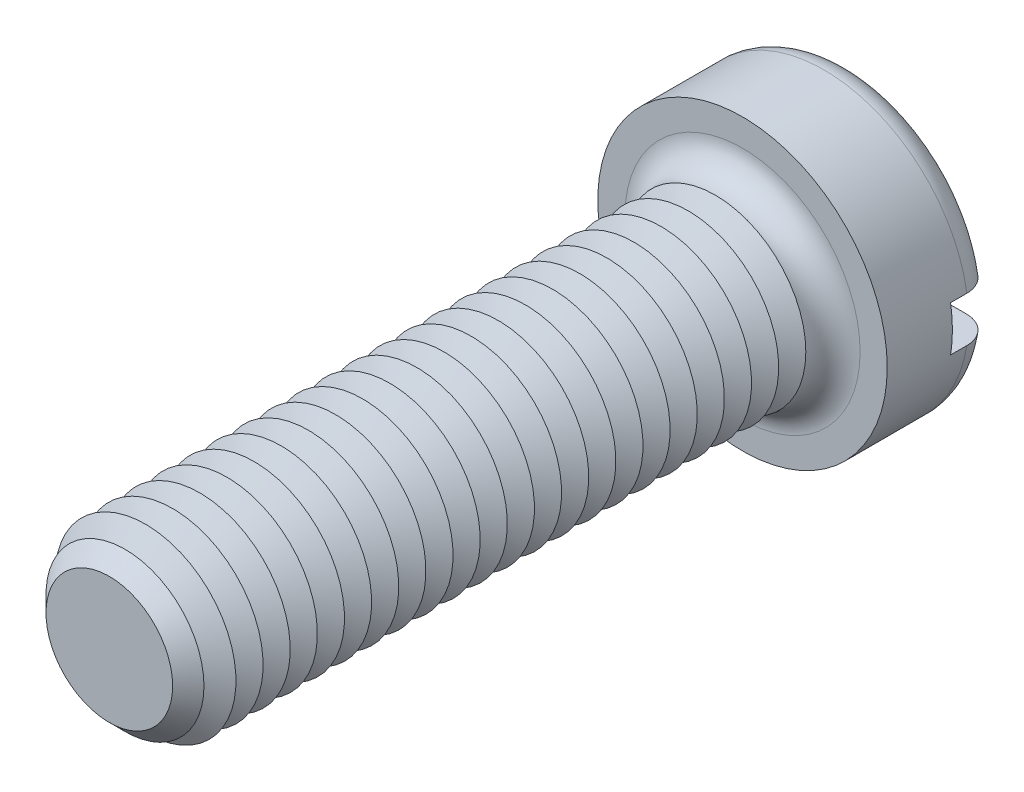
from build123d import *

# Parameters (mm, degrees)
SKETCH3_R           = 8
BOSS_EXTRUDE2_DEPTH = 6
SKETCH4_R           = 5
BOSS_EXTRUDE3_DEPTH = 35
FILLET1_R           = 1.5
CHAMFER1_SIZE       = 1.5
LPATTERN1_COUNT     = 22
LPATTERN1_PITCH     = 1.5
SKETCH8_W           = 16
SKETCH8_H           = 2.5
CUT_EXTRUDE1_DEPTH  = 2.4


with BuildPart() as part:
    # Sketch3 → Boss-Extrude2 (new body)
    with BuildSketch(Plane.XY):
        Circle(SKETCH3_R)
    extrude(amount=-BOSS_EXTRUDE2_DEPTH)

    # Sketch4 → Boss-Extrude3 (add)
    with BuildSketch(Plane.XY):
        Circle(SKETCH4_R)
    extrude(amount=BOSS_EXTRUDE3_DEPTH)

    # Fillet1
    fillet1_edges = [part.edges().sort_by_distance(p)[0] for p in [
        (-8, 0, -6),
        (-5, 0, 0),
    ]]
    fillet(fillet1_edges, radius=FILLET1_R)

    # Chamfer1
    chamfer1_edges = [part.edges().sort_by_distance(p)[0] for p in [
        (-5, 0, 35),
    ]]
    chamfer(chamfer1_edges, length=CHAMFER1_SIZE)

    # Sketch6 → Cut-Revolve1 (revolve, cut)
    with BuildSketch(Plane(origin=(0, 0, 0), x_dir=(0, 0, -1), z_dir=(1, 0, 0)), mode=Mode.PRIVATE) as cut_revolve1_sk:
        Polygon((-1.5, 5), (-2.25, 3.700961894), (-3, 5), align=None)
    cut_revolve1 = revolve(cut_revolve1_sk.sketch.rotate(Axis((0, 0, -1.694361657), (0, 0, 1)), 90), axis=Axis((0, 0, -1.694361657), (0, 0, 1)), mode=Mode.SUBTRACT)

    # LPattern1: Cut-Revolve1 ×22
    with Locations(*[(0, 0, i * LPATTERN1_PITCH) for i in range(1, LPATTERN1_COUNT)]):
        add(cut_revolve1, mode=Mode.SUBTRACT)

    # Sketch8 → Cut-Extrude1 (cut)
    with BuildSketch(Plane(origin=(0, 0, -6), x_dir=(-1, 0, 0), z_dir=(0, 0, -1))):
        Rectangle(SKETCH8_W, SKETCH8_H)
    extrude(amount=-CUT_EXTRUDE1_DEPTH, mode=Mode.SUBTRACT)


solid = part.part
